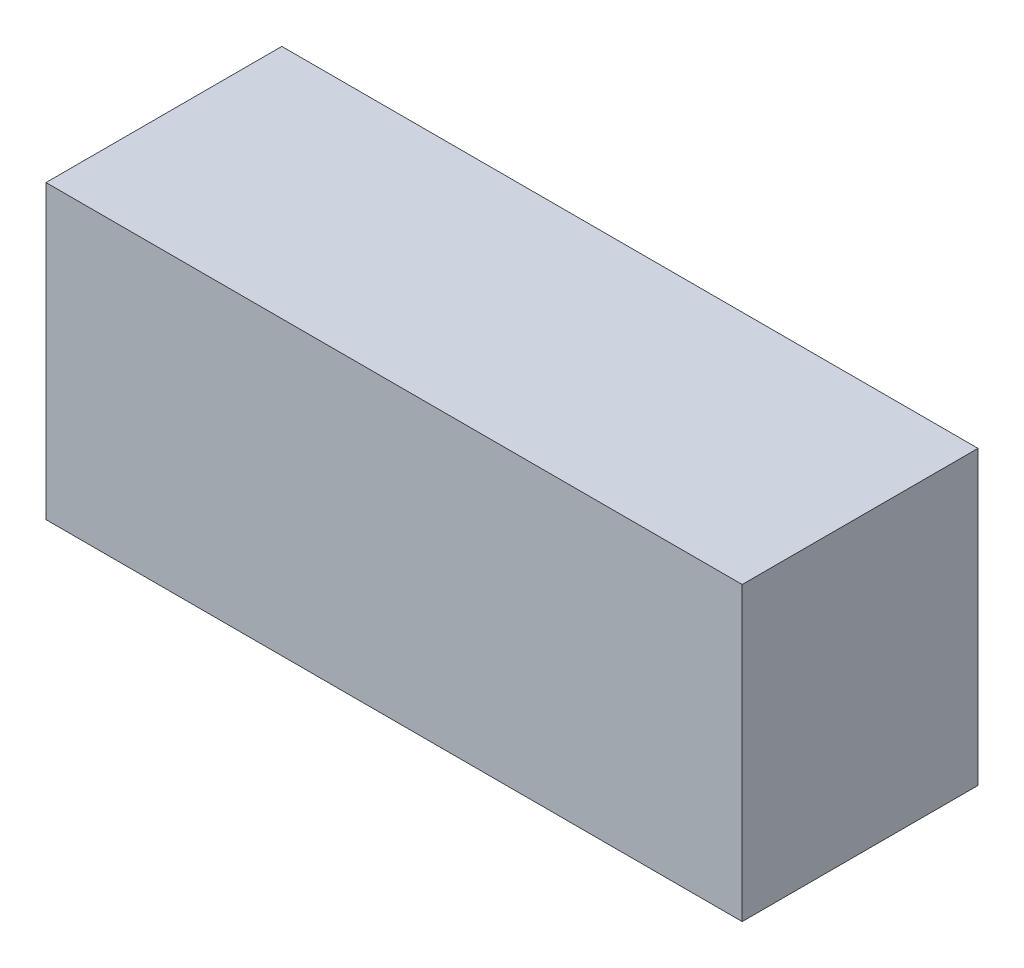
from build123d import *

# Parameters (mm, degrees)
COMPONENT_OUTLINE_W = 7.874
COMPONENT_OUTLINE_H = 3.302
BOSS_EXTRUDE1_DEPTH = 2.667


with BuildPart() as part:
    # Component_Outline → Boss-Extrude1 (new body)
    with BuildSketch(Plane.XY):
        with Locations((-0.063, -0.249)):
            Rectangle(COMPONENT_OUTLINE_W, COMPONENT_OUTLINE_H)
    extrude(amount=BOSS_EXTRUDE1_DEPTH)


solid = part.part
